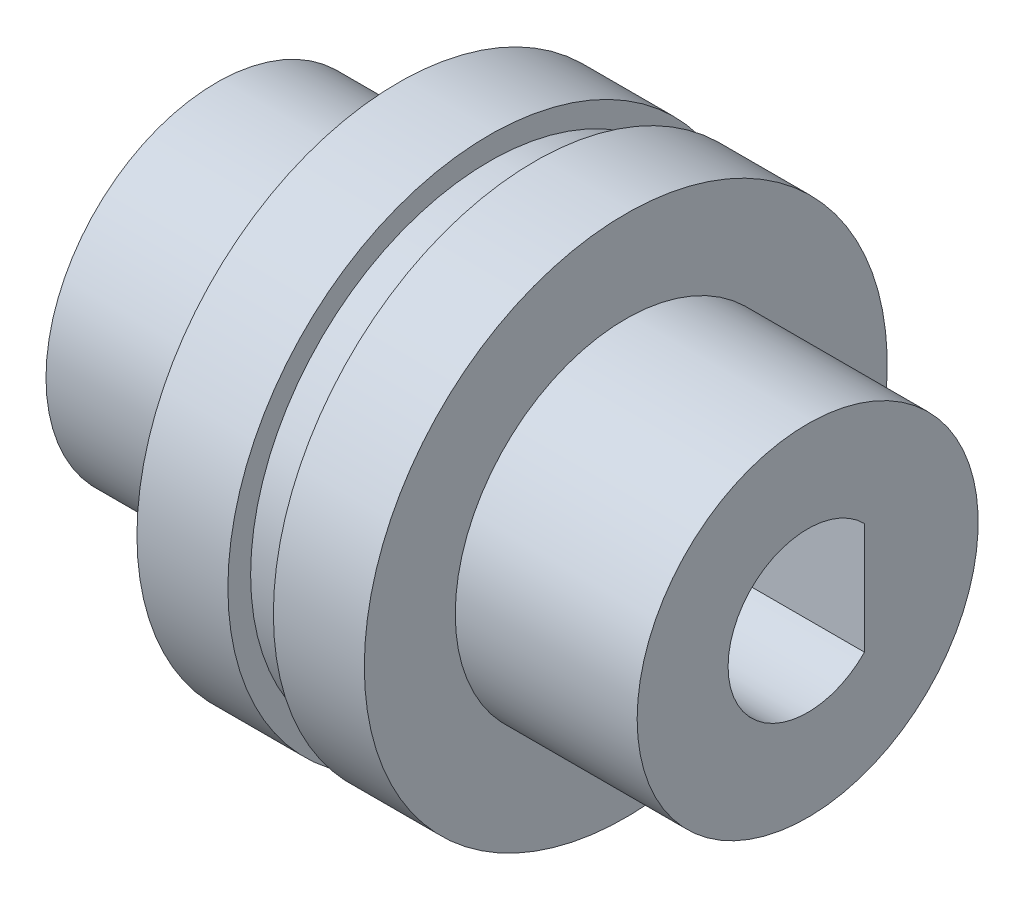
from build123d import *

# Parameters (mm, degrees)
EXTRUDE1_DEPTH = 82.55


with BuildPart() as part:
    # Sketch1 → Base-Revolve (revolve)
    with BuildSketch(Plane.XY, mode=Mode.PRIVATE) as base_revolve_sk:
        Polygon((0, 11.1125), (0, 23.8125), (25.4, 23.8125), (25.4, 36.5125), (38.1, 36.5125), (38.1, 33.3375), (44.45, 33.3375), (44.45, 36.5125), (57.15, 36.5125), (57.15, 23.8125), (82.55, 23.8125), (82.55, 11.1125), align=None)
    revolve(base_revolve_sk.sketch.rotate(Axis((0, 0, 0), (1, 0, 0)), 90), axis=Axis((0, 0, 0), (1, 0, 0)))

    # Sketch2 → Extrude1 (add, through all)
    with BuildSketch(Plane(origin=(0, 0, 0), x_dir=(0, 0, -1), z_dir=(1, 0, 0))):
        with BuildLine():
            Line((7.9375, 7.777129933), (7.9375, -7.777129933))
            ThreePointArc((7.9375, -7.777129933), (11.1125, 0), (7.9375, 7.777129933))
        make_face()
    extrude(amount=EXTRUDE1_DEPTH)


solid = part.part
